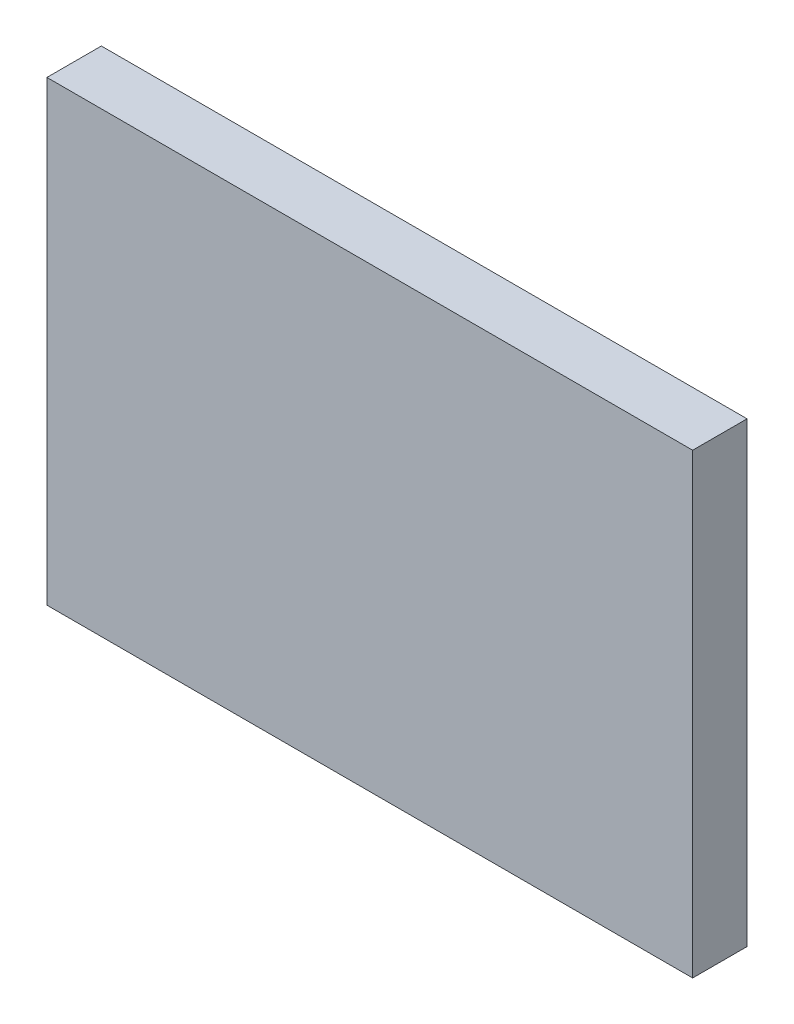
from build123d import *

# Parameters (mm, degrees)
SKETCH1_W           = 35.6
SKETCH1_H           = 25.2
BOSS_EXTRUDE1_DEPTH = 3


with BuildPart() as part:
    # Sketch1 → Boss-Extrude1 (new body)
    with BuildSketch(Plane.XY):
        Rectangle(SKETCH1_W, SKETCH1_H)
    extrude(amount=BOSS_EXTRUDE1_DEPTH)


solid = part.part
